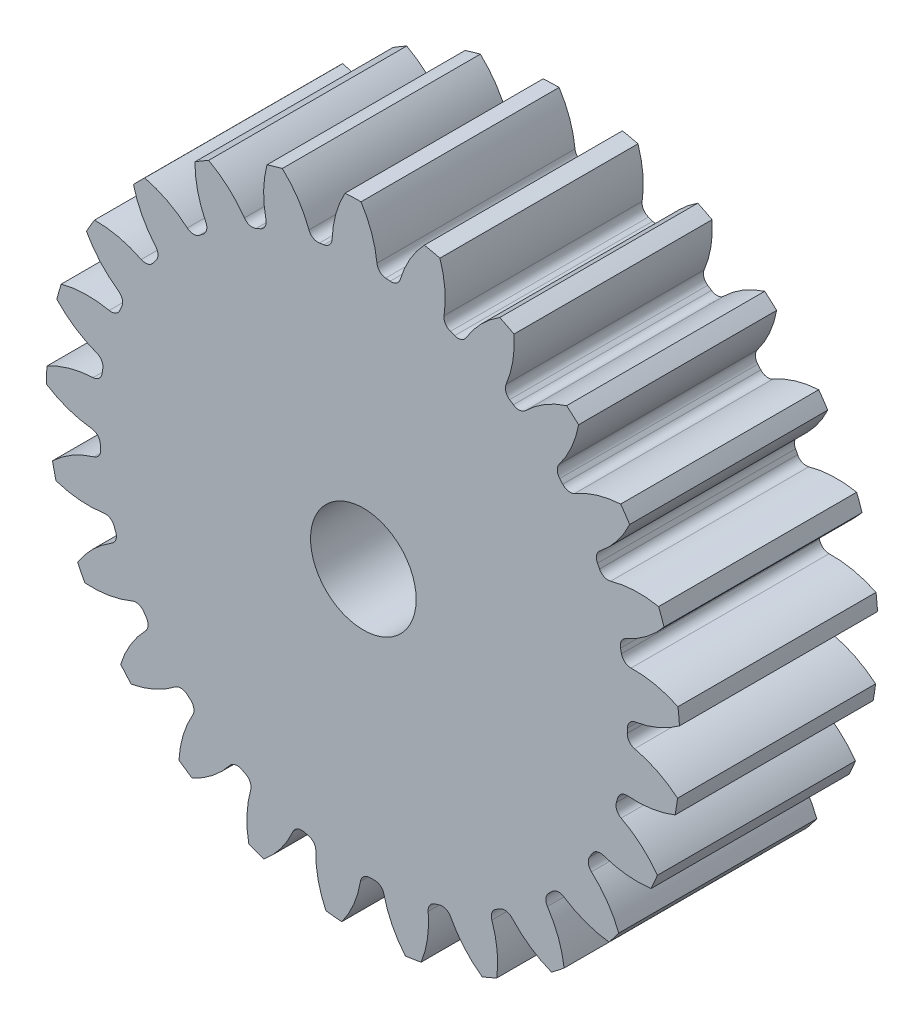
from build123d import *

# Parameters (mm, degrees)
SKETCH3_R         = 152.4
GEARBODY_DEPTH    = 95.25
TOOTHCUT_DEPTH    = 236.635486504
CIRPATTERN1_COUNT = 25
BOREDIA_R         = 25.4
BORE_DEPTH        = 12700


with BuildPart() as part:
    # Sketch3 → gearBody (new body)
    with BuildSketch(Plane.XY):
        Circle(SKETCH3_R)
    extrude(amount=GEARBODY_DEPTH)

    # Sketch2 → toothCut (cut, through all)
    with BuildSketch(Plane.XY):
        with BuildLine():
            ThreePointArc((126.903558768, -4.948411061), (126.941563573, -3.852199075), (126.970099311, -2.755699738))
            ThreePointArc((126.970099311, -2.755699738), (128.086917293, 0.148411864), (130.798145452, 1.67497286))
            ThreePointArc((130.798145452, 1.67497286), (142.155163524, 5.02230758), (152.4, 10.957780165))
            ThreePointArc((152.4, 10.957780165), (152.723127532, -4.634572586), (151.455126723, -20.178640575))
            ThreePointArc((151.455126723, -20.178640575), (141.589048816, -13.632877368), (130.455899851, -9.603050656))
            ThreePointArc((130.455899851, -9.603050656), (127.842226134, -7.914898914), (126.903558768, -4.948411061))
        make_face()
    toothcut = extrude(amount=TOOTHCUT_DEPTH, mode=Mode.SUBTRACT)

    # CirPattern1: toothCut ×25 about axis
    cirpattern1_axis = Axis((0, 0, 0), (0, 0, 1))
    for i in range(1, CIRPATTERN1_COUNT):
        add(toothcut.rotate(cirpattern1_axis, i * 360 / CIRPATTERN1_COUNT), mode=Mode.SUBTRACT)

    # boreDia → bore (cut, symmetric)
    with BuildSketch(Plane.XY):
        Circle(BOREDIA_R)
    extrude(amount=BORE_DEPTH, both=True, mode=Mode.SUBTRACT)


solid = part.part
